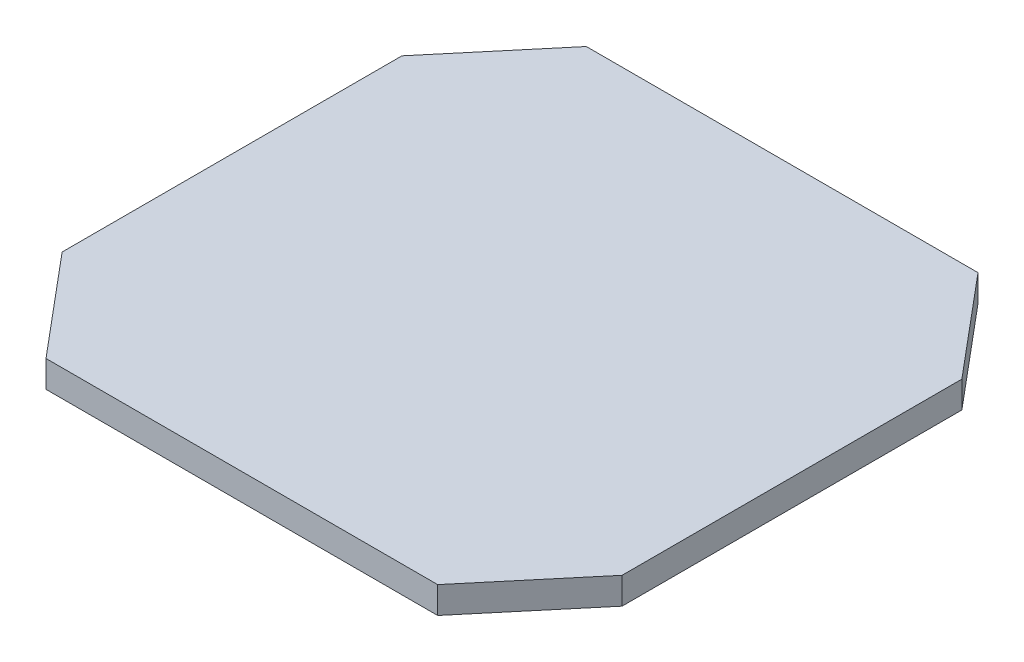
from build123d import *

# Parameters (mm, degrees)
EXTRUDE_1_DEPTH      = 15
SKETCH_3_W           = 29.6
SKETCH_3_H           = 21.6
CUT_EXTRUDE_3_DEPTH  = 1
CUT_EXTRUDE_4_DEPTH  = 1
FILLET_5_R           = 0.3
FILLET_6_R           = 0.2
CUT_EXTRUDE_5_REACH  = 44.202
CUT_EXTRUDE_6_REACH  = 32.232
SKETCH_7_W           = 29
SKETCH_7_H           = 21
CUT_EXTRUDE_7_DEPTH  = 10.5
CUT_EXTRUDE_8_DEPTH  = 1.5
CUT_EXTRUDE_9_DEPTH  = 1.2
EXTRUDE_2_DEPTH      = 10.5
CUT_EXTRUDE_10_DEPTH = 4
CUT_EXTRUDE_START    = -10.401924
CUT_EXTRUDE_13_DEPTH = 10.401924
CUT_EXTRUDE_14_DEPTH = 1.5
SKETCH_18_W          = 29.6
SKETCH_18_H          = 21.6
CUT_EXTRUDE_15_DEPTH = 0.5
EXTRUDE_3_DEPTH      = 10.401924
CUT_EXTRUDE_16_REACH = 44.027
SKETCH_20_W          = 6.5
SKETCH_20_H          = 6.5
CUT_EXTRUDE_17_REACH = 44.027
SKETCH_21_W          = 8.8
SKETCH_21_H          = 3.8
SKETCH_24_R          = 3.1
EXTRUDE_4_DEPTH      = 6
CUT_EXTRUDE_18_REACH = 47.818
SKETCH_25_R          = 2.55
EXTRUDE_5_REACH      = 43.879
SKETCH_27_R          = 3.1
CUT_EXTRUDE_19_REACH = 43.879
SKETCH_30_R          = 2.55
EXTRUDE_6_REACH      = 43.879
SKETCH_31_R          = 3.1
SKETCH_31_R_2        = 2.55
EXTRUDE_8_DEPTH      = 1.5
CUT_EXTRUDE_START_2  = -14.5
CUT_EXTRUDE_20_DEPTH = 14.5


with BuildPart() as part:
    # Sketch 1 → Extrude 1 (new body)
    with BuildSketch(Plane(origin=(0, 0, 0), x_dir=(1, 0, 0), z_dir=(0, 1, 0))):
        Polygon((-11.26009429, 20), (-11.965402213, 16), (-17, 10), (-17, -10), (-11.965402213, -16), (-11.26009429, -20), (11.26009429, -20), (11.965402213, -16), (17, -10), (17, 10), (11.965402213, 16), (11.26009429, 20), align=None)
    extrude(amount=EXTRUDE_1_DEPTH)

    # Sketch 3 → Cut-Extrude 3 (cut)
    with BuildSketch(Plane(origin=(0, 15, 0), x_dir=(1, 0, 0), z_dir=(0, 1, 0))):
        Polygon((-11.26009429, 20), (11.26009429, 20), (11.965402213, 16), (17, 10), (17, -10), (11.965402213, -16), (11.26009429, -20), (-11.26009429, -20), (-11.965402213, -16), (-17, -10), (-17, 10), (-11.965402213, 16), align=None)
        Rectangle(SKETCH_3_W, SKETCH_3_H, mode=Mode.SUBTRACT)
    extrude(amount=-CUT_EXTRUDE_3_DEPTH, mode=Mode.SUBTRACT)

    # Sketch 5 → Cut-Extrude 4 (cut)
    with BuildSketch(Plane(origin=(0, 14, 0), x_dir=(1, 0, 0), z_dir=(0, 1, 0))):
        Polygon((-11.26009429, 20), (11.26009429, 20), (11.965402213, 16), (17, 10), (17, -10), (11.965402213, -16), (11.26009429, -20), (-11.26009429, -20), (-11.965402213, -16), (-17, -10), (-17, 10), (-11.965402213, 16), align=None)
        Polygon((13.707389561, 12.679401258), (16.2, 9.708823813), (16.2, -9.708823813), (13.707389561, -12.679401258), (-13.707389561, -12.679401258), (-16.2, -9.708823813), (-16.2, 9.708823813), (-13.707389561, 12.679401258), align=None, mode=Mode.SUBTRACT)
    extrude(amount=-CUT_EXTRUDE_4_DEPTH, mode=Mode.SUBTRACT)

    # Fillet 5
    fillet_5_edges = [part.edges().sort_by_distance(p)[0] for p in [
        (16.2, 14, 0),
        (14.95369478, 14, 11.194112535),
        (0, 14, 12.679401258),
        (-14.95369478, 14, 11.194112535),
        (-16.2, 14, 0),
        (-14.95369478, 14, -11.194112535),
        (0, 14, -12.679401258),
        (14.95369478, 14, -11.194112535),
    ]]
    fillet(fillet_5_edges, radius=FILLET_5_R)

    # Fillet 6
    fillet_6_edges = [part.edges().sort_by_distance(p)[0] for p in [
        (16.2, 13, 0),
        (14.95369478, 13, -11.194112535),
        (0, 13, -12.679401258),
        (-14.95369478, 13, -11.194112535),
        (-16.2, 13, 0),
        (-14.95369478, 13, 11.194112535),
        (0, 13, 12.679401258),
        (14.95369478, 13, 11.194112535),
    ]]
    fillet(fillet_6_edges, radius=FILLET_6_R)

    # Sketch 6 → Cut-Extrude 5 (cut, up to next)
    with BuildSketch(Plane(origin=(17, 0, 0), x_dir=(0, 0, -1), z_dir=(1, 0, 0)), mode=Mode.PRIVATE) as cut_extrude_5_sk1:
        Polygon((-15.5, 13), (-20, 10.401923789), (-20, 13), align=None)
    cut_extrude_5_tool1 = extrude(cut_extrude_5_sk1.sketch, amount=-CUT_EXTRUDE_5_REACH, mode=Mode.PRIVATE) & part.part
    # Sketch 6 → Cut-Extrude 5 (cut, up to next)
    with BuildSketch(Plane(origin=(17, 0, 0), x_dir=(0, 0, -1), z_dir=(1, 0, 0)), mode=Mode.PRIVATE) as cut_extrude_5_sk2:
        Polygon((15.5, 13), (20, 10.401923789), (20, 13), align=None)
    cut_extrude_5_tool2 = extrude(cut_extrude_5_sk2.sketch, amount=-CUT_EXTRUDE_5_REACH, mode=Mode.PRIVATE) & part.part
    add(cut_extrude_5_tool1.solids().sort_by_distance((17, 12.133975, 18.5))[0], mode=Mode.SUBTRACT)
    add(cut_extrude_5_tool2.solids().sort_by_distance((17, 12.133975, -18.5))[0], mode=Mode.SUBTRACT)

    # Sketch 7 → Cut-Extrude 6 (cut, up to next)
    with BuildSketch(Plane(origin=(0, 15, 0), x_dir=(1, 0, 0), z_dir=(0, 1, 0)), mode=Mode.PRIVATE) as cut_extrude_6_sk1:
        Rectangle(SKETCH_7_W, SKETCH_7_H)
    cut_extrude_6_tool1 = extrude(cut_extrude_6_sk1.sketch, amount=-CUT_EXTRUDE_6_REACH, mode=Mode.PRIVATE) & part.part
    add(cut_extrude_6_tool1.solids().sort_by_distance((0, 15, 0))[0], mode=Mode.SUBTRACT)

    # Sketch 8 → Cut-Extrude 7 (cut)
    with BuildSketch(Plane.XZ):
        Polygon((10.952395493, -17.138030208), (-10.952395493, -17.138030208), (-11.214779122, -15.649978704), (-16.2, -9.708823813), (-16.2, 9.708823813), (-11.214779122, 15.649978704), (-10.969079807, 17.04340876), (10.969079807, 17.04340876), (11.214779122, 15.649978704), (16.2, 9.708823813), (16.2, -9.708823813), (11.214779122, -15.649978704), align=None)
    extrude(amount=-CUT_EXTRUDE_7_DEPTH, mode=Mode.SUBTRACT)

    # Sketch 9 → Cut-Extrude 8 (cut)
    with BuildSketch(Plane.XZ.offset(-10.5)):
        Polygon((-11.241224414, 15.5), (11.241224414, 15.5), (11.214779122, 15.649978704), (16.2, 9.708823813), (16.2, -9.708823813), (11.214779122, -15.649978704), (11.241224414, -15.5), (-11.241224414, -15.5), (-11.214779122, -15.649978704), (-16.2, -9.708823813), (-16.2, 9.708823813), (-11.214779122, 15.649978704), align=None)
    extrude(amount=-CUT_EXTRUDE_8_DEPTH, mode=Mode.SUBTRACT)

    # Sketch 11 → Cut-Extrude 9 (cut)
    with BuildSketch(Plane.XZ.offset(-12)):
        Polygon((-13.3809742, 11.979401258), (13.3809742, 11.979401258), (15.5, 9.454044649), (15.5, -9.454044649), (13.3809742, -11.979401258), (-13.3809742, -11.979401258), (-15.5, -9.454044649), (-15.5, 9.454044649), align=None)
    extrude(amount=-CUT_EXTRUDE_9_DEPTH, mode=Mode.SUBTRACT)

    # Sketch 12 → Extrude 2 (add)
    with BuildSketch(Plane.XZ.offset(-10.5)):
        Polygon((-11.214779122, -15.649978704), (-10.952395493, -17.138030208), (10.952395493, -17.138030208), (11.214779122, -15.649978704), align=None)
        Polygon((11.214779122, 15.649978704), (10.969079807, 17.04340876), (-10.969079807, 17.04340876), (-11.214779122, 15.649978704), align=None)
    extrude(amount=EXTRUDE_2_DEPTH)

    # Sketch 13 → Cut-Extrude 10 (cut)
    with BuildSketch(Plane.XZ):
        Polygon((-10.244667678, 20), (10.244667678, 20), (10.835366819, 16.649978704), (-10.835366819, 16.649978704), align=None)
    cut_extrude_10 = extrude(amount=-CUT_EXTRUDE_10_DEPTH, mode=Mode.SUBTRACT)

    # Mirror 1: Cut-Extrude 10 across plane
    add(cut_extrude_10.mirror(Plane.XY), mode=Mode.SUBTRACT)

    # Sketch 15 → Cut-Extrude 13 (cut)
    with BuildSketch(Plane.XZ.offset(CUT_EXTRUDE_START)):
        Polygon((-10.420994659, 19), (-11.214779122, 15.649978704), (11.214779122, 15.649978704), (10.420994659, 19), align=None)
    cut_extrude_13 = extrude(amount=CUT_EXTRUDE_13_DEPTH, mode=Mode.SUBTRACT)

    # Mirror 2: Cut-Extrude 13 across plane
    add(cut_extrude_13.mirror(Plane.XY), mode=Mode.SUBTRACT)

    # Sketch 16 → Cut-Extrude 14 (cut)
    with BuildSketch(Plane.XZ.offset(-10.5)):
        Polygon((-11.214779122, 15.649978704), (-11.241224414, 15.5), (11.241224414, 15.5), (11.214779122, 15.649978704), align=None)
        Polygon((-11.241224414, -15.5), (-11.214779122, -15.649978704), (11.214779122, -15.649978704), (11.241224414, -15.5), align=None)
    extrude(amount=-CUT_EXTRUDE_14_DEPTH, mode=Mode.SUBTRACT)

    # Sketch 18 → Cut-Extrude 15 (cut)
    with BuildSketch(Plane(origin=(0, 15, 0), x_dir=(1, 0, 0), z_dir=(0, 1, 0))):
        Rectangle(SKETCH_18_W, SKETCH_18_H)
    extrude(amount=-CUT_EXTRUDE_15_DEPTH, mode=Mode.SUBTRACT)

    # Sketch 19 → Extrude 3 (add)
    with BuildSketch(Plane.XZ.offset(-10.401923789)):
        Polygon((-9.420994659, 19), (-10.420994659, 19), (-11.214779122, 15.649978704), (-9.420994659, 15.649978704), align=None)
        Polygon((11.214779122, 15.649978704), (10.420994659, 19), (9.420994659, 19), (9.420994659, 15.649978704), align=None)
    extrude_3 = extrude(amount=EXTRUDE_3_DEPTH)

    # Mirror 3: Extrude 3 across plane
    add(extrude_3.mirror(Plane.XY))

    # Sketch 20 → Cut-Extrude 16 (cut, up to next)
    with BuildSketch(Plane.ZY.offset(17), mode=Mode.PRIVATE) as cut_extrude_16_sk1:
        with Locations((-5.75, 6.25)):
            Rectangle(SKETCH_20_W, SKETCH_20_H)
    cut_extrude_16_tool1 = extrude(cut_extrude_16_sk1.sketch, amount=-CUT_EXTRUDE_16_REACH, mode=Mode.PRIVATE) & part.part
    # Sketch 20 → Cut-Extrude 16 (cut, up to next)
    with BuildSketch(Plane.ZY.offset(17), mode=Mode.PRIVATE) as cut_extrude_16_sk2:
        with Locations((5.75, 6.25)):
            Rectangle(SKETCH_20_W, SKETCH_20_H)
    cut_extrude_16_tool2 = extrude(cut_extrude_16_sk2.sketch, amount=-CUT_EXTRUDE_16_REACH, mode=Mode.PRIVATE) & part.part
    add(cut_extrude_16_tool1.solids().sort_by_distance((-17, 6.25, -5.75))[0], mode=Mode.SUBTRACT)
    add(cut_extrude_16_tool2.solids().sort_by_distance((-17, 6.25, 5.75))[0], mode=Mode.SUBTRACT)

    # Sketch 21 → Cut-Extrude 17 (cut, up to next)
    with BuildSketch(Plane(origin=(17, 0, 0), x_dir=(0, 0, -1), z_dir=(1, 0, 0)), mode=Mode.PRIVATE) as cut_extrude_17_sk1:
        with Locations((0, 6.4)):
            Rectangle(SKETCH_21_W, SKETCH_21_H)
    cut_extrude_17_tool1 = extrude(cut_extrude_17_sk1.sketch, amount=-CUT_EXTRUDE_17_REACH, mode=Mode.PRIVATE) & part.part
    add(cut_extrude_17_tool1.solids().sort_by_distance((17, 6.4, 0))[0], mode=Mode.SUBTRACT)

    # Sketch 24 → Extrude 4 (add)
    with BuildSketch(Plane(origin=(0, 0, -20), x_dir=(-1, 0, 0), z_dir=(0, 0, -1))):
        with Locations((-5, 7.25)):
            Circle(SKETCH_24_R)
        with Locations((5, 7.25)):
            Circle(SKETCH_24_R)
    extrude(amount=-EXTRUDE_4_DEPTH)

    # Sketch 25 → Cut-Extrude 18 (cut, up to next)
    with BuildSketch(Plane(origin=(0, 0, -20), x_dir=(-1, 0, 0), z_dir=(0, 0, -1)), mode=Mode.PRIVATE) as cut_extrude_18_sk1:
        with Locations((-5, 7.25)):
            Circle(SKETCH_25_R)
    cut_extrude_18_tool1 = extrude(cut_extrude_18_sk1.sketch, amount=-CUT_EXTRUDE_18_REACH, mode=Mode.PRIVATE) & part.part
    # Sketch 25 → Cut-Extrude 18 (cut, up to next)
    with BuildSketch(Plane(origin=(0, 0, -20), x_dir=(-1, 0, 0), z_dir=(0, 0, -1)), mode=Mode.PRIVATE) as cut_extrude_18_sk2:
        with Locations((5, 7.25)):
            Circle(SKETCH_25_R)
    cut_extrude_18_tool2 = extrude(cut_extrude_18_sk2.sketch, amount=-CUT_EXTRUDE_18_REACH, mode=Mode.PRIVATE) & part.part
    add(cut_extrude_18_tool1.solids().sort_by_distance((5, 7.25, -20))[0], mode=Mode.SUBTRACT)
    add(cut_extrude_18_tool2.solids().sort_by_distance((-5, 7.25, -20))[0], mode=Mode.SUBTRACT)

    # Extrude 5: up to this plane
    extrude_5_end = Plane(origin=(-16.2, 60.097035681, -9.708823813), z_dir=(-0.7660444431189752, 0, -0.6427876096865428))
    # Sketch 27 → Extrude 5 (add, up to the surface)
    with BuildSketch(Plane(origin=(-4.676551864, 0.171522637, -12.843270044), x_dir=(-0.016131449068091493, 0.9996850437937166, 0.01922471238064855), z_dir=(0.3421213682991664, -0.01254803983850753, 0.9395719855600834)), mode=Mode.PRIVATE) as extrude_5_sk1:
        with Locations(Location((5.975472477, 8.413965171, 0), (0, 0, 268.754546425))):
            Circle(SKETCH_27_R)
    extrude_5_tool1 = split(extrude(extrude_5_sk1.sketch, amount=-EXTRUDE_5_REACH, mode=Mode.PRIVATE), bisect_by=extrude_5_end, keep=Keep.BOTH, mode=Mode.PRIVATE)
    add(extrude_5_tool1.solids().sort_by_distance((-12.678011, 5.962245, -9.852406))[0])

    # Cut-Extrude 19: up to this plane
    cut_extrude_19_end = Plane(origin=(-11.965402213, 15, -16), z_dir=(0.7660444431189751, 0, 0.6427876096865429))
    # Sketch 30 → Cut-Extrude 19 (cut, up to the surface)
    with BuildSketch(Plane(origin=(-4.676551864, 0.171522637, -12.843270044), x_dir=(-0.016131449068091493, 0.9996850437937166, 0.01922471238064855), z_dir=(0.3421213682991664, -0.01254803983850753, 0.9395719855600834)), mode=Mode.PRIVATE) as cut_extrude_19_sk1:
        with Locations(Location((5.975472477, 8.413965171, 0), (0, 0, 268.754546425))):
            Circle(SKETCH_30_R)
    cut_extrude_19_tool1 = split(extrude(cut_extrude_19_sk1.sketch, amount=-CUT_EXTRUDE_19_REACH, mode=Mode.PRIVATE), bisect_by=cut_extrude_19_end, keep=Keep.BOTH, mode=Mode.PRIVATE)
    cut_extrude_19 = cut_extrude_19_tool1.solids().sort_by_distance((-12.678011, 5.962245, -9.852406))[0]
    add(cut_extrude_19, mode=Mode.SUBTRACT)

    # Mirror 4: Cut-Extrude 19 across plane
    add(cut_extrude_19.mirror(Plane(origin=(0, 0, 0), x_dir=(0, 0, 1), z_dir=(1, 0, 0))), mode=Mode.SUBTRACT)

    # Extrude 6: up to this plane
    extrude_6_end = Plane(origin=(11.214779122, 60.097035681, -15.649978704), z_dir=(0.7660444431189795, 0, -0.6427876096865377))
    # Sketch 31 → Extrude 6 (add, up to the surface)
    with BuildSketch(Plane(origin=(4.676551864, 0.171522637, -12.843270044), x_dir=(0.016131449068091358, 0.9996850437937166, 0.01922471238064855), z_dir=(0.3421213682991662, 0.012548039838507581, -0.9395719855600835)), mode=Mode.PRIVATE) as extrude_6_sk1:
        with Locations(Location((5.975472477, 8.413965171, 0), (0, 0, 90))):
            Circle(SKETCH_31_R)
        with Locations(Location((5.975472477, 8.413965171, 0), (0, 0, 90))):
            Circle(SKETCH_31_R_2, mode=Mode.SUBTRACT)
    extrude_6_tool1 = split(extrude(extrude_6_sk1.sketch, amount=EXTRUDE_6_REACH, mode=Mode.PRIVATE), bisect_by=extrude_6_end, keep=Keep.BOTH, mode=Mode.PRIVATE)
    add(extrude_6_tool1.solids().sort_by_distance((9.847885, 6.027715, -10.88205))[0])

    # Sketch 33 → Cut-Extrude 20 (cut)
    with BuildSketch(Plane.XZ.offset(CUT_EXTRUDE_START_2)):
        Polygon((-11.26009429, 20), (-11.965402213, 16), (-17, 10), (-17, -10), (-11.965402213, -16), (-11.26009429, -20), (11.26009429, -20), (11.965402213, -16), (17, -10), (17, 10), (11.965402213, 16), (11.26009429, 20), align=None)
    extrude(amount=CUT_EXTRUDE_20_DEPTH, mode=Mode.SUBTRACT)


with BuildPart() as body_2:
    # Sketch 32 → Extrude 8 (new body)
    with BuildSketch(Plane.XZ):
        Polygon((-10.981625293, 15.149978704), (10.981625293, 15.149978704), (15.7, 9.526838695), (15.7, -9.526838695), (10.981625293, -15.149978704), (-10.981625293, -15.149978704), (-15.7, -9.526838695), (-15.7, 9.526838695), align=None)
    extrude(amount=EXTRUDE_8_DEPTH)


solid = body_2.part
